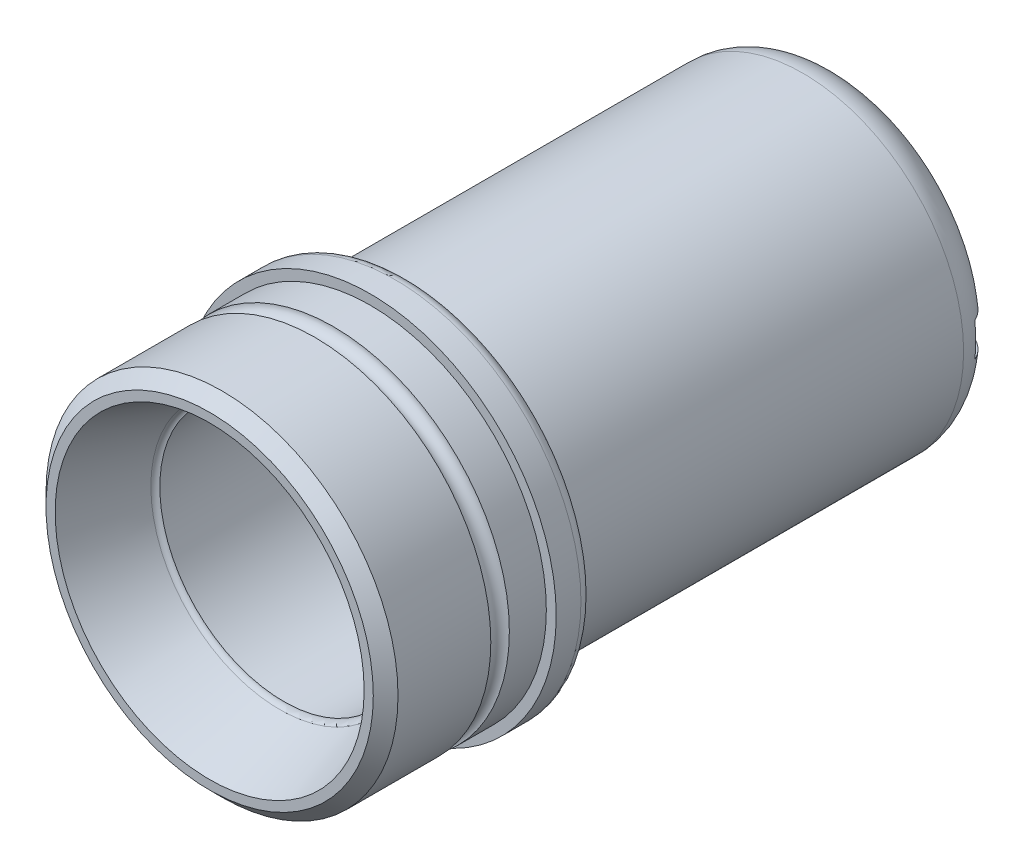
from build123d import *

# Parameters (mm, degrees)
SKETCH_2_W          = 2.778125
SKETCH_2_H          = 4.365625
CUT_EXTRUDE_1_DEPTH = 24.13
SKETCH_3_W          = 1.5875
SKETCH_3_H          = 2.38125


with BuildPart() as part:
    # Sketch 1 → Revolve 1 (revolve)
    with BuildSketch(Plane(origin=(0, 0, 0), x_dir=(0, 0, -1), z_dir=(1, 0, 0)), mode=Mode.PRIVATE) as revolve_1_sk:
        with BuildLine():
            Line((0, 19.84375), (0, 21.0185))
            Line((0, 21.0185), (1.5875, 22.606))
            Line((1.5875, 22.606), (13.50645, 22.606))
            ThreePointArc((13.50645, 22.606), (14.697075, 21.43125), (15.8877, 22.606))
            Line((15.8877, 22.606), (20.6375, 22.606))
            Line((20.6375, 22.606), (20.6375, 23.876))
            Line((20.6375, 23.876), (23.8125, 23.876))
            ThreePointArc((23.8125, 23.876), (24.935032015, 23.411032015), (25.4, 22.2885))
            Line((25.4, 22.2885), (25.4, 21.43125))
            ThreePointArc((25.4, 21.43125), (25.632483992, 20.869983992), (26.19375, 20.6375))
            Line((26.19375, 20.6375), (76.2, 20.6375))
            ThreePointArc((76.2, 20.6375), (79.567596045, 19.242596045), (80.9625, 15.875))
            Line((80.9625, 15.875), (80.9625, 9.1186))
            Line((80.9625, 9.1186), (76.368384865, 9.1186))
            Line((76.368384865, 9.1186), (61.3664, 17.78))
            Line((61.3664, 17.78), (27.2542, 17.78))
            Line((27.2542, 17.78), (25.4, 15.9258))
            Line((25.4, 15.9258), (9.525, 15.9258))
            ThreePointArc((9.525, 15.9258), (9.356399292, 16.31677389), (9.010015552, 16.564372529))
            Line((9.010015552, 16.564372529), (0, 19.84375))
        make_face()
    revolve(revolve_1_sk.sketch.rotate(Axis((0, 0, 0), (0, 0, -1)), 90), axis=Axis((0, 0, 0), (0, 0, -1)))

    # Sketch 2 → Cut-Extrude 1 (cut, symmetric)
    with BuildSketch(Plane(origin=(0, 0, 0), x_dir=(0, 0, -1), z_dir=(1, 0, 0))):
        with Locations((79.5734375, 0)):
            Rectangle(SKETCH_2_W, SKETCH_2_H)
    extrude(amount=CUT_EXTRUDE_1_DEPTH, both=True, mode=Mode.SUBTRACT)

    # Sketch 3 → Cut-Revolve 1 (revolve, cut)
    with BuildSketch(Plane(origin=(0, 0, 0), x_dir=(0, 0, -1), z_dir=(0, 1, 0))):
        with Locations((21.43125, 22.685375)):
            Rectangle(SKETCH_3_W, SKETCH_3_H)
    revolve(axis=Axis((-16.718795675, 0, -20.6375), (-1, 0, 0)), mode=Mode.SUBTRACT)


solid = part.part
